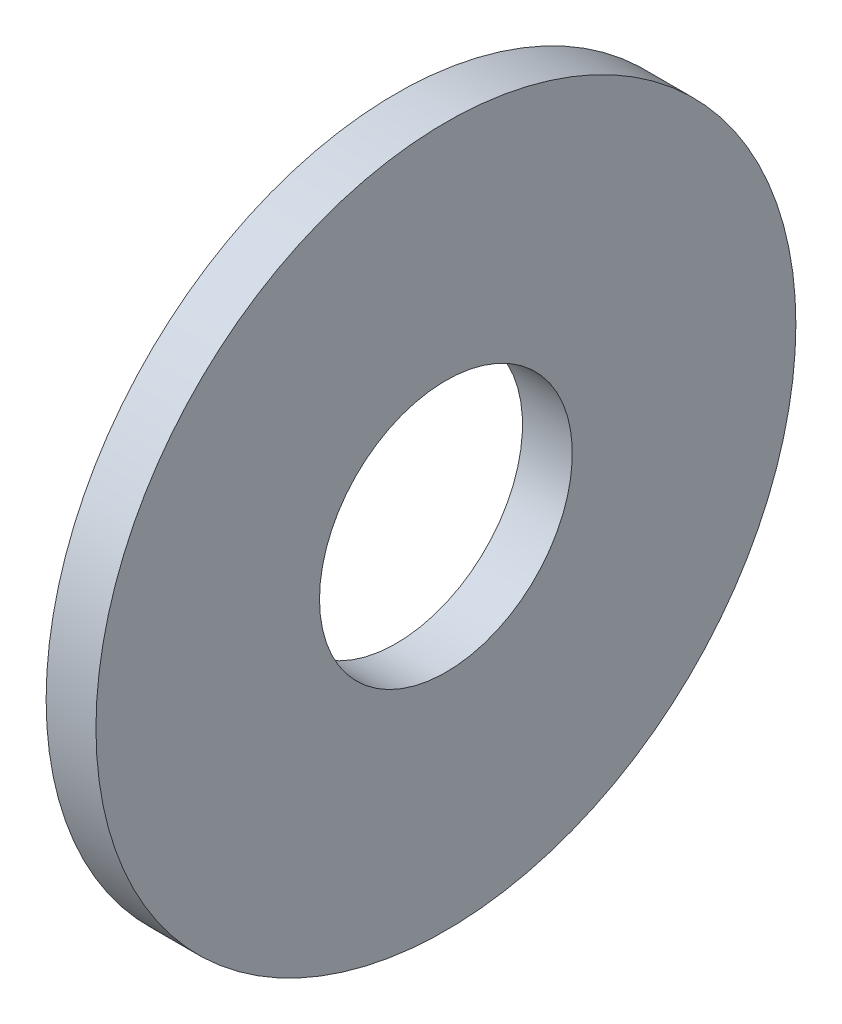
from build123d import *

# Parameters (mm, degrees)
SKETCH1_W = 1.016
SKETCH1_H = 4.5593


with BuildPart() as part:
    # Sketch1 → Base-Revolve (revolve)
    with BuildSketch(Plane.XY, mode=Mode.PRIVATE) as base_revolve_sk:
        with Locations((-0.508, 4.85775)):
            Rectangle(SKETCH1_W, SKETCH1_H)
    revolve(base_revolve_sk.sketch.rotate(Axis((-34.925, 0, 0), (1, 0, 0)), 90), axis=Axis((-34.925, 0, 0), (1, 0, 0)))


solid = part.part
